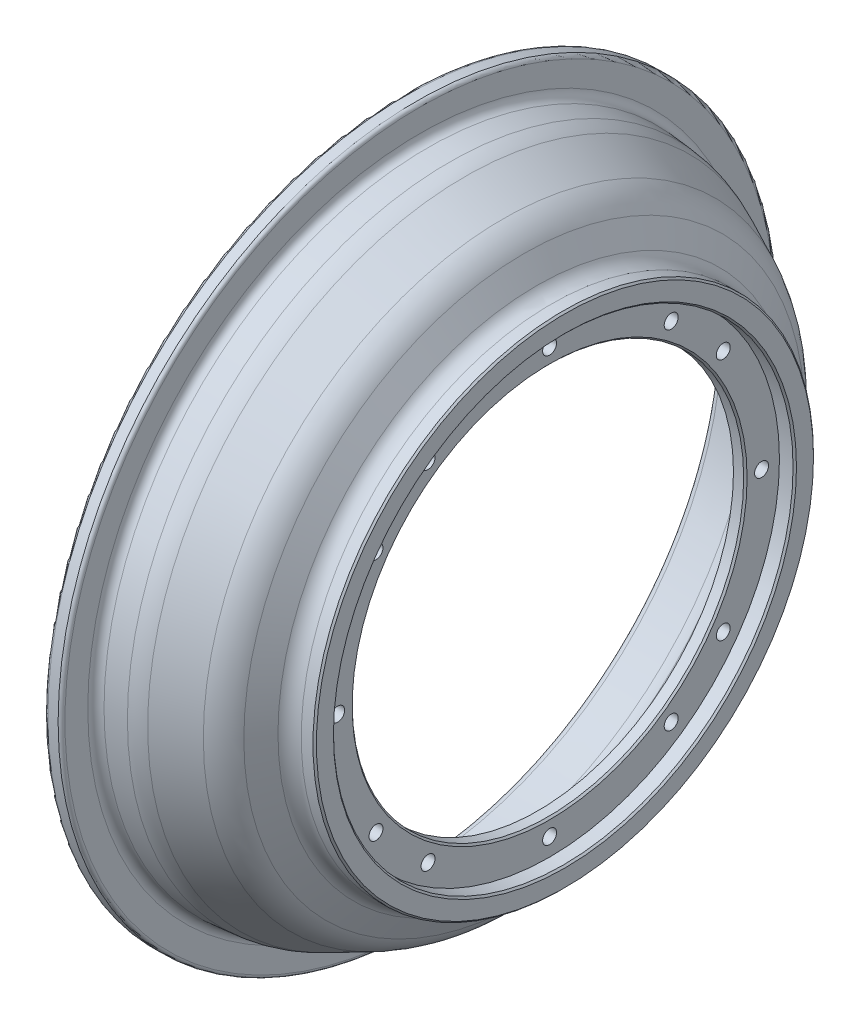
from build123d import *

# Parameters (mm, degrees)
SKETCH2_R          = 4.1
CUT_EXTRUDE1_DEPTH = 10
CIRPATTERN1_COUNT  = 4
FILLET1_R          = 20
FILLET2_R          = 28
FILLET3_R          = 10
CHAMFER1_SIZE      = 1
FILLET4_R          = 6
FILLET5_R          = 5
FILLET6_R          = 2
SKETCH4_R          = 6
CUT_EXTRUDE2_DEPTH = 36


with BuildPart() as part:
    # Sketch1 → Revolve1 (revolve)
    with BuildSketch(Plane.XY, mode=Mode.PRIVATE) as revolve1_sk:
        Polygon((0, 135), (-9, 135), (-9, 115), (-16, 115), (-16, 135), (-33.995223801, 166.168641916), (-65.2, 180.719668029), (-95.2, 183.344327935), (-95.2, 210.5), (-85.2, 210.5), (-85.2, 190.5), (-63.097506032, 188.566282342), (-28.328215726, 172.353096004), (-13.690598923, 147), (0, 147), align=None)
    revolve(revolve1_sk.sketch.rotate(Axis((0, 0, 0), (-1, 0, 0)), 90), axis=Axis((0, 0, 0), (-1, 0, 0)))

    # Sketch2 → Cut-Extrude1 (cut)
    with BuildSketch(Plane.ZY.offset(16)):
        with Locations((0, 124.5)):
            Circle(SKETCH2_R)
        with Locations((71.410266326, 101.984429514)):
            Circle(SKETCH2_R)
        with Locations((101.984429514, 71.410266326)):
            Circle(SKETCH2_R)
    cut_extrude1 = extrude(amount=-CUT_EXTRUDE1_DEPTH, mode=Mode.SUBTRACT)

    # CirPattern1: Cut-Extrude1 ×4 about axis
    cirpattern1_axis = Axis((0, 0, 0), (1, 0, 0))
    for i in range(1, CIRPATTERN1_COUNT):
        add(cut_extrude1.rotate(cirpattern1_axis, i * 360 / CIRPATTERN1_COUNT), mode=Mode.SUBTRACT)

    # Fillet1
    fillet1_edges = [part.edges().sort_by_distance(p)[0] for p in [
        (-65.2, 0, 180.719668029),
        (-33.995223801, 0, 166.168641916),
    ]]
    fillet(fillet1_edges, radius=FILLET1_R)

    # Fillet2
    fillet2_edges = [part.edges().sort_by_distance(p)[0] for p in [
        (-28.328215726, 0, 172.353096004),
        (-63.097506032, 0, 188.566282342),
    ]]
    fillet(fillet2_edges, radius=FILLET2_R)

    # Fillet3
    fillet3_edges = [part.edges().sort_by_distance(p)[0] for p in [
        (-13.690598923, 0, 147),
    ]]
    fillet(fillet3_edges, radius=FILLET3_R)

    # Chamfer1
    chamfer1_edges = [part.edges().sort_by_distance(p)[0] for p in [
        (0, 0, 147),
        (-9, 0, 115),
        (0, 0, 135),
    ]]
    chamfer(chamfer1_edges, length=CHAMFER1_SIZE)

    # Fillet4
    fillet4_edges = [part.edges().sort_by_distance(p)[0] for p in [
        (-16, 0, 135),
    ]]
    fillet(fillet4_edges, radius=FILLET4_R)

    # Fillet5
    fillet5_edges = [part.edges().sort_by_distance(p)[0] for p in [
        (-85.2, 0, 190.5),
        (-95.2, 0, 183.344327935),
    ]]
    fillet(fillet5_edges, radius=FILLET5_R)

    # Fillet6
    fillet6_edges = [part.edges().sort_by_distance(p)[0] for p in [
        (-85.2, 0, 210.5),
        (-95.2, 0, 210.5),
    ]]
    fillet(fillet6_edges, radius=FILLET6_R)

    # Sketch4 → Cut-Extrude2 (cut)
    with BuildSketch(Plane(origin=(-58.517229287, 0, -157.604326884), x_dir=(0.9063077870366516, 0, 0.42261826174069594), z_dir=(-0.42261826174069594, 0, 0.9063077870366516))):
        Circle(SKETCH4_R)
    extrude(amount=-CUT_EXTRUDE2_DEPTH, mode=Mode.SUBTRACT)


solid = part.part
